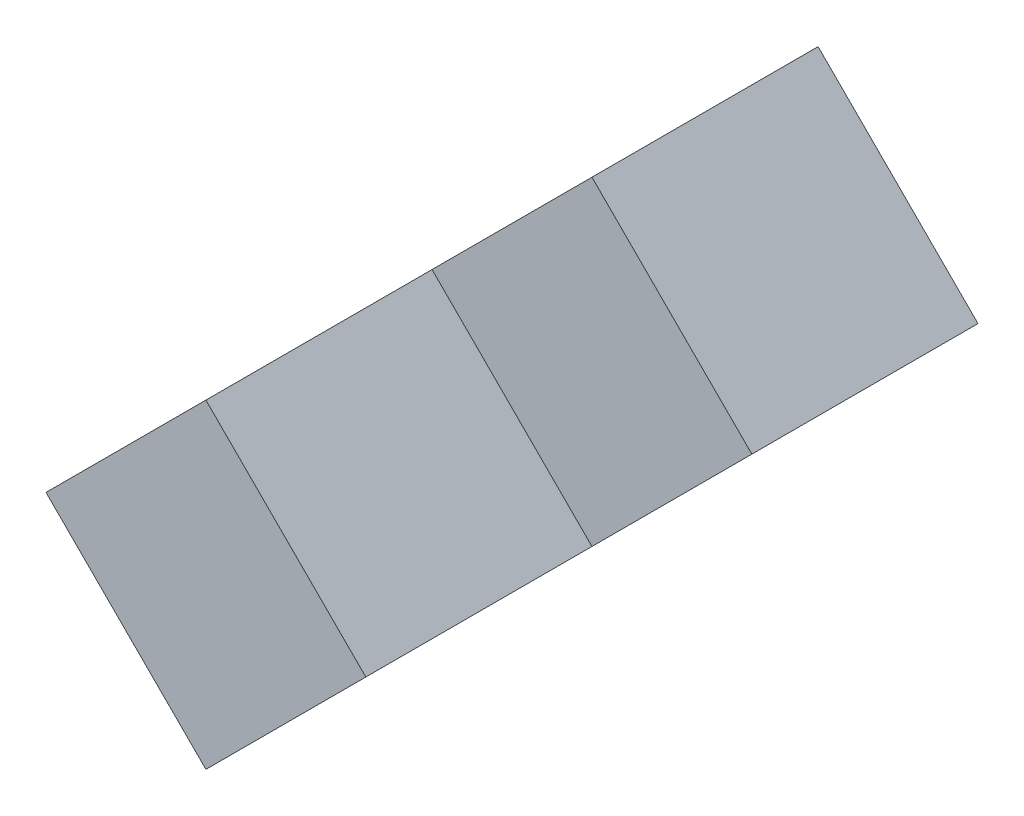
from build123d import *

# Parameters (mm, degrees)
EXTRUIR1_DEPTH = 20


with BuildPart() as part:
    # Croquis2 → Extruir1 (new body)
    with BuildSketch(Plane(origin=(0, 0, 0), x_dir=(0, 0, 1), z_dir=(-0.7071067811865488, 0.7071067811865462, 0))):
        Polygon((26.803884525, 30), (26.803884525, -30), (46.803884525, -30), (46.803884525, -10), (66.803884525, -10), (66.803884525, 10), (46.803884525, 10), (46.803884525, 30), align=None)
    extrude(amount=EXTRUIR1_DEPTH)


solid = part.part
